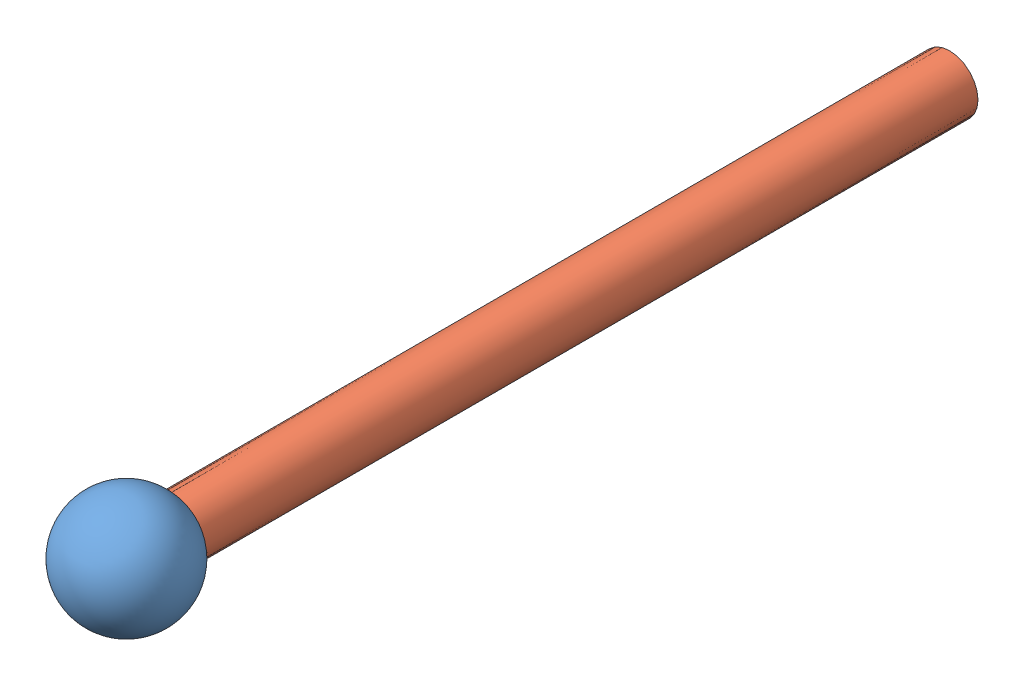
SolidWorks assembly ShortMarker_StickAndBall.SLDASM, configuration Default (file format 13000). Lengths in mm.
Overall size (6 6 46.4).
2 component instances, 2 part files, 1 mates.
Components (placement in the parent):
- MarkerBall-1: MarkerBall.SLDPRT [Default] at (-2.4965 2.3943 7.6053) size (6 6 6)
- ShortmarkerStick-1: ShortmarkerStick.SLDPRT [Default] at (-2.4965 2.3943 -35.7928) size (3 3 40.8)
Mates (geometry in assembly coordinates):
- Coincident1: coincident: sphere of MarkerBall-1; circle of ShortmarkerStick-1
